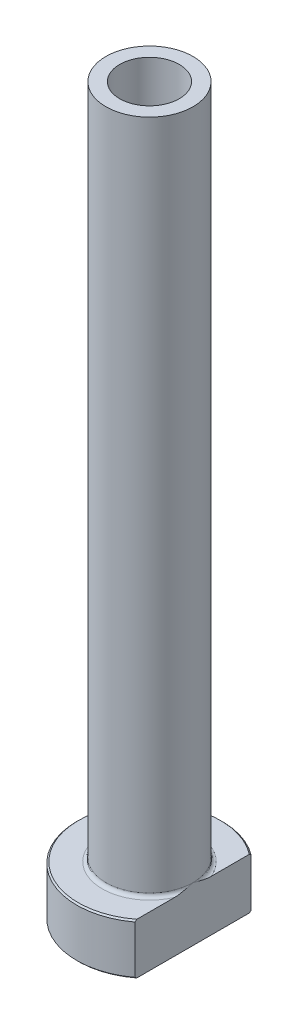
from build123d import *

# Parameters (mm, degrees)
FILLET1_R          = 0.5
CHAMFER1_SIZE      = 0.2
CUT_EXTRUDE1_DEPTH = 101.995049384
CHAMFER2_SIZE      = 0.5


with BuildPart() as part:
    # Sketch1 → Revolve1 (revolve)
    with BuildSketch(Plane.XY, mode=Mode.PRIVATE) as revolve1_sk:
        Polygon((-4.1, 100), (-6, 100), (-6, 7), (-10, 7), (-10, 0), (-4.35, 0), (-4.35, 43), (-4.1, 55), align=None)
    revolve(revolve1_sk.sketch.rotate(Axis((0, 92.187680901, 0), (0, -1, 0)), 270), axis=Axis((0, 92.187680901, 0), (0, -1, 0)))

    # Fillet1
    fillet1_edges = [part.edges().sort_by_distance(p)[0] for p in [
        (0, 7, -6),
    ]]
    fillet(fillet1_edges, radius=FILLET1_R)

    # Chamfer1
    chamfer1_edges = [part.edges().sort_by_distance(p)[0] for p in [
        (0, 0, -10),
        (0, 7, -10),
    ]]
    chamfer(chamfer1_edges, length=CHAMFER1_SIZE)

    # Sketch2 → Cut-Extrude1 (cut, through all)
    with BuildSketch(Plane.XZ):
        with BuildLine():
            Line((6, 8), (6, -8))
            ThreePointArc((6, -8), (10, 0), (6, 8))
        make_face()
    extrude(amount=-CUT_EXTRUDE1_DEPTH, mode=Mode.SUBTRACT)

    # Chamfer2
    chamfer2_edges = [part.edges().sort_by_distance(p)[0] for p in [
        (0, 0, -4.35),
    ]]
    chamfer(chamfer2_edges, length=CHAMFER2_SIZE)


solid = part.part
